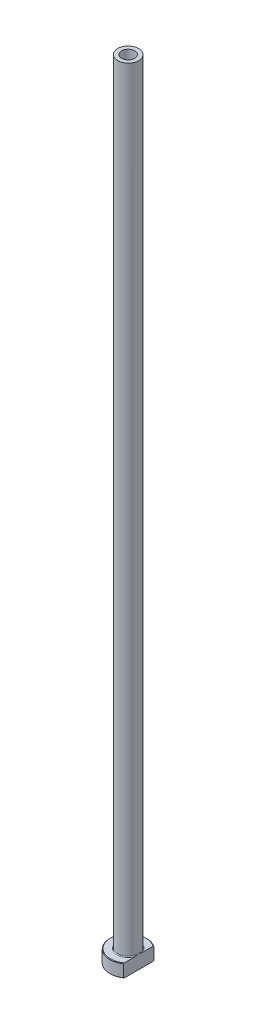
from build123d import *

# Parameters (mm, degrees)
FILLET1_R          = 0.3
CHAMFER1_SIZE      = 0.2
CUT_EXTRUDE1_DEPTH = 301.163288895
CHAMFER2_SIZE      = 0.5


with BuildPart() as part:
    # Sketch1 → Revolve1 (revolve)
    with BuildSketch(Plane.XY, mode=Mode.PRIVATE) as revolve1_sk:
        Polygon((-2.5, 300), (-4, 300), (-4, 5), (-7, 5), (-7, 0), (-2.75, 0), (-2.75, 243), (-2.5, 255), align=None)
    revolve(revolve1_sk.sketch.rotate(Axis((0, 92.187680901, 0), (0, -1, 0)), 270), axis=Axis((0, 92.187680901, 0), (0, -1, 0)))

    # Fillet1
    fillet1_edges = [part.edges().sort_by_distance(p)[0] for p in [
        (0, 5, -4),
    ]]
    fillet(fillet1_edges, radius=FILLET1_R)

    # Chamfer1
    chamfer1_edges = [part.edges().sort_by_distance(p)[0] for p in [
        (0, 0, -7),
        (0, 5, -7),
    ]]
    chamfer(chamfer1_edges, length=CHAMFER1_SIZE)

    # Sketch2 → Cut-Extrude1 (cut, through all)
    with BuildSketch(Plane.XZ):
        with BuildLine():
            Line((4, 5.744562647), (4, -5.744562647))
            ThreePointArc((4, -5.744562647), (7, 0), (4, 5.744562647))
        make_face()
    extrude(amount=-CUT_EXTRUDE1_DEPTH, mode=Mode.SUBTRACT)

    # Chamfer2
    chamfer2_edges = [part.edges().sort_by_distance(p)[0] for p in [
        (0, 0, -2.75),
    ]]
    chamfer(chamfer2_edges, length=CHAMFER2_SIZE)


solid = part.part
